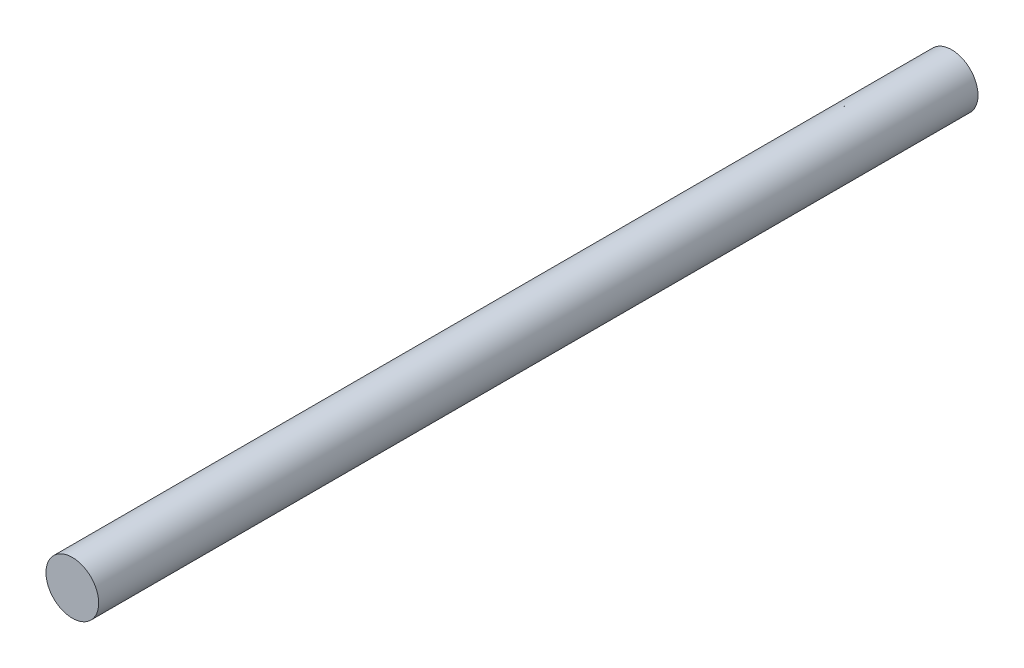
ISO-10303-21;
HEADER;
FILE_DESCRIPTION(('STEP AP214'),'2;1');
FILE_NAME('part.step','',(''),(''),'','','');
FILE_SCHEMA(('AUTOMOTIVE_DESIGN { 1 0 10303 214 1 1 1 1 }'));
ENDSEC;
DATA;
#1=APPLICATION_CONTEXT('core data for automotive mechanical design processes');
#2=APPLICATION_PROTOCOL_DEFINITION('international standard','automotive_design',2000,#1);
#3=PRODUCT_CONTEXT('',#1,'mechanical');
#4=PRODUCT('Part','Part','',(#3));
#5=PRODUCT_RELATED_PRODUCT_CATEGORY('part','',(#4));
#6=PRODUCT_DEFINITION_FORMATION('','',#4);
#7=PRODUCT_DEFINITION_CONTEXT('part definition',#1,'design');
#8=PRODUCT_DEFINITION('design','',#6,#7);
#9=PRODUCT_DEFINITION_SHAPE('','',#8);
#10=(LENGTH_UNIT() NAMED_UNIT(*) SI_UNIT(.MILLI.,.METRE.));
#11=(NAMED_UNIT(*) PLANE_ANGLE_UNIT() SI_UNIT($,.RADIAN.));
#12=(NAMED_UNIT(*) SI_UNIT($,.STERADIAN.) SOLID_ANGLE_UNIT());
#13=UNCERTAINTY_MEASURE_WITH_UNIT(LENGTH_MEASURE(1.E-05),#10,'distance_accuracy_value','');
#14=(GEOMETRIC_REPRESENTATION_CONTEXT(3) GLOBAL_UNCERTAINTY_ASSIGNED_CONTEXT((#13)) GLOBAL_UNIT_ASSIGNED_CONTEXT((#10,
#11,#12)) REPRESENTATION_CONTEXT('',''));
#15=CARTESIAN_POINT('',(0.,0.,0.));
#16=DIRECTION('',(0.,0.,1.));
#17=DIRECTION('',(1.,0.,0.));
#18=AXIS2_PLACEMENT_3D('',#15,#16,#17);
#19=CARTESIAN_POINT('',(0.,0.,-500.));
#20=DIRECTION('',(0.,0.,1.));
#21=DIRECTION('',(1.,0.,0.));
#22=AXIS2_PLACEMENT_3D('',#19,#20,#21);
#23=CYLINDRICAL_SURFACE('',#22,30.);
#24=CARTESIAN_POINT('',(0.,0.,-500.));
#25=DIRECTION('',(0.,0.,1.));
#26=DIRECTION('',(1.,0.,0.));
#27=AXIS2_PLACEMENT_3D('',#24,#25,#26);
#28=CIRCLE('',#27,30.);
#29=CARTESIAN_POINT('',(30.,0.,-500.));
#30=VERTEX_POINT('',#29);
#31=EDGE_CURVE('E11',#30,#30,#28,.T.);
#32=ORIENTED_EDGE('',*,*,#31,.T.);
#33=EDGE_LOOP('',(#32));
#34=FACE_BOUND('',#33,.T.);
#35=CARTESIAN_POINT('',(0.,0.,500.));
#36=DIRECTION('',(0.,0.,1.));
#37=DIRECTION('',(1.,0.,0.));
#38=AXIS2_PLACEMENT_3D('',#35,#36,#37);
#39=CIRCLE('',#38,30.);
#40=CARTESIAN_POINT('',(30.,0.,500.));
#41=VERTEX_POINT('',#40);
#42=EDGE_CURVE('E46',#41,#41,#39,.T.);
#43=ORIENTED_EDGE('',*,*,#42,.F.);
#44=EDGE_LOOP('',(#43));
#45=FACE_BOUND('',#44,.T.);
#46=ADVANCED_FACE('F39',(#34,#45),#23,.T.);
#47=CARTESIAN_POINT('',(0.,0.,-500.));
#48=DIRECTION('',(0.,0.,1.));
#49=DIRECTION('',(1.,0.,0.));
#50=AXIS2_PLACEMENT_3D('',#47,#48,#49);
#51=PLANE('',#50);
#52=ORIENTED_EDGE('',*,*,#31,.F.);
#53=EDGE_LOOP('',(#52));
#54=FACE_BOUND('',#53,.T.);
#55=ADVANCED_FACE('F109',(#54),#51,.F.);
#56=CARTESIAN_POINT('',(0.,0.,500.));
#57=DIRECTION('',(0.,0.,1.));
#58=DIRECTION('',(1.,0.,0.));
#59=AXIS2_PLACEMENT_3D('',#56,#57,#58);
#60=PLANE('',#59);
#61=ORIENTED_EDGE('',*,*,#42,.T.);
#62=EDGE_LOOP('',(#61));
#63=FACE_BOUND('',#62,.T.);
#64=ADVANCED_FACE('F107',(#63),#60,.T.);
#65=CLOSED_SHELL('',(#46,#55,#64));
#66=CARTESIAN_POINT('',(0.,0.,-495.));
#67=DIRECTION('',(0.,0.,1.));
#68=DIRECTION('',(1.,0.,0.));
#69=AXIS2_PLACEMENT_3D('',#66,#67,#68);
#70=CYLINDRICAL_SURFACE('',#69,25.);
#71=CARTESIAN_POINT('',(0.,0.,0.));
#72=DIRECTION('',(0.,0.,-1.));
#73=DIRECTION('',(-1.,0.,0.));
#74=AXIS2_PLACEMENT_3D('',#71,#72,#73);
#75=CIRCLE('',#74,25.);
#76=CARTESIAN_POINT('',(-25.,0.,0.));
#77=VERTEX_POINT('',#76);
#78=EDGE_CURVE('E59',#77,#77,#75,.T.);
#79=ORIENTED_EDGE('',*,*,#78,.F.);
#80=EDGE_LOOP('',(#79));
#81=FACE_BOUND('',#80,.T.);
#82=CARTESIAN_POINT('',(0.,0.,-495.));
#83=DIRECTION('',(0.,0.,1.));
#84=DIRECTION('',(1.,0.,0.));
#85=AXIS2_PLACEMENT_3D('',#82,#83,#84);
#86=CIRCLE('',#85,25.);
#87=CARTESIAN_POINT('',(25.,0.,-495.));
#88=VERTEX_POINT('',#87);
#89=EDGE_CURVE('E50',#88,#88,#86,.T.);
#90=ORIENTED_EDGE('',*,*,#89,.F.);
#91=EDGE_LOOP('',(#90));
#92=FACE_BOUND('',#91,.T.);
#93=ADVANCED_FACE('F102',(#81,#92),#70,.F.);
#94=CARTESIAN_POINT('',(0.,0.,-495.));
#95=DIRECTION('',(0.,0.,1.));
#96=DIRECTION('',(1.,0.,0.));
#97=AXIS2_PLACEMENT_3D('',#94,#95,#96);
#98=PLANE('',#97);
#99=ORIENTED_EDGE('',*,*,#89,.T.);
#100=EDGE_LOOP('',(#99));
#101=FACE_BOUND('',#100,.T.);
#102=ADVANCED_FACE('F92',(#101),#98,.T.);
#103=CARTESIAN_POINT('',(0.,25.,0.));
#104=DIRECTION('',(0.,0.,-1.));
#105=DIRECTION('',(-1.,0.,0.));
#106=AXIS2_PLACEMENT_3D('',#103,#104,#105);
#107=PLANE('',#106);
#108=ORIENTED_EDGE('',*,*,#78,.T.);
#109=EDGE_LOOP('',(#108));
#110=FACE_BOUND('',#109,.T.);
#111=CARTESIAN_POINT('',(0.,0.,0.));
#112=DIRECTION('',(0.,0.,-1.));
#113=DIRECTION('',(-1.,0.,0.));
#114=AXIS2_PLACEMENT_3D('',#111,#112,#113);
#115=CIRCLE('',#114,24.5);
#116=CARTESIAN_POINT('',(-24.5,0.,0.));
#117=VERTEX_POINT('',#116);
#118=EDGE_CURVE('E62',#117,#117,#115,.T.);
#119=ORIENTED_EDGE('',*,*,#118,.F.);
#120=EDGE_LOOP('',(#119));
#121=FACE_BOUND('',#120,.T.);
#122=ADVANCED_FACE('F86',(#110,#121),#107,.T.);
#123=CARTESIAN_POINT('',(0.,24.5,21.));
#124=DIRECTION('',(1.,0.,0.));
#125=DIRECTION('',(0.,0.,-1.));
#126=AXIS2_PLACEMENT_3D('',#123,#124,#125);
#127=ELLIPSE('',#126,21.,14.);
#128=CARTESIAN_POINT('',(0.,0.,0.));
#129=DIRECTION('',(0.,0.,-1.));
#130=AXIS1_PLACEMENT('',#128,#129);
#131=SURFACE_OF_REVOLUTION('',#127,#130);
#132=ORIENTED_EDGE('',*,*,#118,.T.);
#133=EDGE_LOOP('',(#132));
#134=FACE_BOUND('',#133,.T.);
#135=CARTESIAN_POINT('',(0.,0.,21.));
#136=DIRECTION('',(0.,0.,-1.));
#137=DIRECTION('',(-1.,0.,0.));
#138=AXIS2_PLACEMENT_3D('',#135,#136,#137);
#139=CIRCLE('',#138,10.5);
#140=CARTESIAN_POINT('',(-10.5,0.,21.));
#141=VERTEX_POINT('',#140);
#142=EDGE_CURVE('E65',#141,#141,#139,.T.);
#143=ORIENTED_EDGE('',*,*,#142,.F.);
#144=EDGE_LOOP('',(#143));
#145=FACE_BOUND('',#144,.T.);
#146=ADVANCED_FACE('F81',(#134,#145),#131,.F.);
#147=CARTESIAN_POINT('',(0.,0.,0.));
#148=DIRECTION('',(0.,0.,-1.));
#149=DIRECTION('',(-1.,0.,0.));
#150=AXIS2_PLACEMENT_3D('',#147,#148,#149);
#151=CYLINDRICAL_SURFACE('',#150,10.5000002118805);
#152=ORIENTED_EDGE('',*,*,#142,.T.);
#153=EDGE_LOOP('',(#152));
#154=FACE_BOUND('',#153,.T.);
#155=CARTESIAN_POINT('',(0.,0.,33.6));
#156=DIRECTION('',(0.,0.,-1.));
#157=DIRECTION('',(-1.,0.,0.));
#158=AXIS2_PLACEMENT_3D('',#155,#156,#157);
#159=CIRCLE('',#158,10.500000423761);
#160=CARTESIAN_POINT('',(-10.500000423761,0.,33.6));
#161=VERTEX_POINT('',#160);
#162=EDGE_CURVE('E68',#161,#161,#159,.T.);
#163=ORIENTED_EDGE('',*,*,#162,.F.);
#164=EDGE_LOOP('',(#163));
#165=FACE_BOUND('',#164,.T.);
#166=ADVANCED_FACE('F85',(#154,#165),#151,.F.);
#167=CARTESIAN_POINT('',(0.,10.500000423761,33.6));
#168=DIRECTION('',(0.,0.,1.));
#169=DIRECTION('',(1.,0.,0.));
#170=AXIS2_PLACEMENT_3D('',#167,#168,#169);
#171=PLANE('',#170);
#172=ORIENTED_EDGE('',*,*,#162,.T.);
#173=EDGE_LOOP('',(#172));
#174=FACE_BOUND('',#173,.T.);
#175=CARTESIAN_POINT('',(0.,0.,33.6));
#176=DIRECTION('',(0.,0.,-1.));
#177=DIRECTION('',(-1.,0.,0.));
#178=AXIS2_PLACEMENT_3D('',#175,#176,#177);
#179=CIRCLE('',#178,13.500000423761);
#180=CARTESIAN_POINT('',(-13.500000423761,0.,33.6));
#181=VERTEX_POINT('',#180);
#182=EDGE_CURVE('E71',#181,#181,#179,.T.);
#183=ORIENTED_EDGE('',*,*,#182,.F.);
#184=EDGE_LOOP('',(#183));
#185=FACE_BOUND('',#184,.T.);
#186=ADVANCED_FACE('F148',(#174,#185),#171,.T.);
#187=CARTESIAN_POINT('',(0.,25.,33.6));
#188=DIRECTION('',(-1.,0.,0.));
#189=DIRECTION('',(0.,0.,-1.));
#190=AXIS2_PLACEMENT_3D('',#187,#188,#189);
#191=ELLIPSE('',#190,28.6000000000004,11.4999995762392);
#192=CARTESIAN_POINT('',(0.,0.,0.));
#193=DIRECTION('',(0.,0.,-1.));
#194=AXIS1_PLACEMENT('',#192,#193);
#195=SURFACE_OF_REVOLUTION('',#191,#194);
#196=ORIENTED_EDGE('',*,*,#182,.T.);
#197=EDGE_LOOP('',(#196));
#198=FACE_BOUND('',#197,.T.);
#199=CARTESIAN_POINT('',(0.,0.,4.99999999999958));
#200=DIRECTION('',(0.,0.,-1.));
#201=DIRECTION('',(-1.,0.,0.));
#202=AXIS2_PLACEMENT_3D('',#199,#200,#201);
#203=CIRCLE('',#202,25.0000000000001);
#204=CARTESIAN_POINT('',(-25.0000000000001,0.,4.99999999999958));
#205=VERTEX_POINT('',#204);
#206=EDGE_CURVE('E74',#205,#205,#203,.T.);
#207=ORIENTED_EDGE('',*,*,#206,.F.);
#208=EDGE_LOOP('',(#207));
#209=FACE_BOUND('',#208,.T.);
#210=ADVANCED_FACE('F98',(#198,#209),#195,.F.);
#211=CARTESIAN_POINT('',(0.,0.,495.));
#212=DIRECTION('',(0.,0.,1.));
#213=DIRECTION('',(1.,0.,0.));
#214=AXIS2_PLACEMENT_3D('',#211,#212,#213);
#215=PLANE('',#214);
#216=CARTESIAN_POINT('',(0.,0.,495.));
#217=DIRECTION('',(0.,0.,1.));
#218=DIRECTION('',(1.,0.,0.));
#219=AXIS2_PLACEMENT_3D('',#216,#217,#218);
#220=CIRCLE('',#219,25.);
#221=CARTESIAN_POINT('',(25.,0.,495.));
#222=VERTEX_POINT('',#221);
#223=EDGE_CURVE('E54',#222,#222,#220,.T.);
#224=ORIENTED_EDGE('',*,*,#223,.F.);
#225=EDGE_LOOP('',(#224));
#226=FACE_BOUND('',#225,.T.);
#227=ADVANCED_FACE('F94',(#226),#215,.F.);
#228=ORIENTED_EDGE('',*,*,#206,.T.);
#229=EDGE_LOOP('',(#228));
#230=FACE_BOUND('',#229,.T.);
#231=ORIENTED_EDGE('',*,*,#223,.T.);
#232=EDGE_LOOP('',(#231));
#233=FACE_BOUND('',#232,.T.);
#234=ADVANCED_FACE('F97',(#230,#233),#70,.F.);
#235=CLOSED_SHELL('',(#93,#102,#122,#146,#166,#186,#210,#227,#234));
#236=ORIENTED_CLOSED_SHELL('',*,#235,.T.);
#237=BREP_WITH_VOIDS('B2',#65,(#236));
#238=ADVANCED_BREP_SHAPE_REPRESENTATION('',(#18,#237),#14);
#239=SHAPE_DEFINITION_REPRESENTATION(#9,#238);
ENDSEC;
END-ISO-10303-21;
